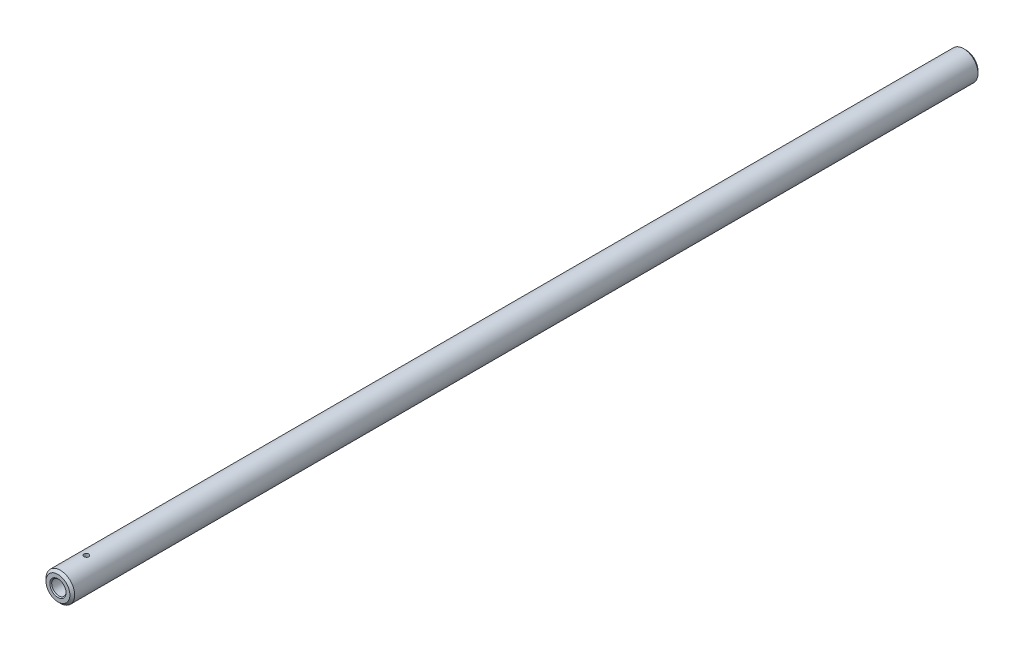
from build123d import *

# Parameters (mm, degrees)
ESQUISSE1_R             = 3
BOSS_EXTRU_1_DEPTH      = 190
ESQUISSE2_R             = 1.5
ENL_V_MAT_EXTRU_1_DEPTH = 10
CHANFREIN1_SIZE         = 0.2
CHANFREIN2_SIZE         = 0.5
ESQUISSE3_R             = 0.5
ENL_V_MAT_EXTRU_2_DEPTH = 5


with BuildPart() as part:
    # Esquisse1 → Boss.-Extru.1 (new body)
    with BuildSketch(Plane.XY):
        Circle(ESQUISSE1_R)
    extrude(amount=BOSS_EXTRU_1_DEPTH)

    # Esquisse2 → Enl_v. mat.-Extru.1 (cut)
    with BuildSketch(Plane.XY.offset(190)):
        Circle(ESQUISSE2_R)
    extrude(amount=-ENL_V_MAT_EXTRU_1_DEPTH, mode=Mode.SUBTRACT)

    # Chanfrein1
    chanfrein1_edges = [part.edges().sort_by_distance(p)[0] for p in [
        (-1.5, 0, 190),
    ]]
    chamfer(chanfrein1_edges, length=CHANFREIN1_SIZE)

    # Chanfrein2
    chanfrein2_edges = [part.edges().sort_by_distance(p)[0] for p in [
        (-3, 0, 0),
        (-3, 0, 190),
    ]]
    chamfer(chanfrein2_edges, length=CHANFREIN2_SIZE)

    # Esquisse3 → Enl_v. mat.-Extru.2 (cut, symmetric)
    with BuildSketch(Plane(origin=(0, 0, 0), x_dir=(1, 0, 0), z_dir=(0, 1, 0))):
        with Locations(Location((0, -184.07660586, 0), (0, 0, 270))):
            Circle(ESQUISSE3_R)
    extrude(amount=ENL_V_MAT_EXTRU_2_DEPTH, both=True, mode=Mode.SUBTRACT)


solid = part.part
